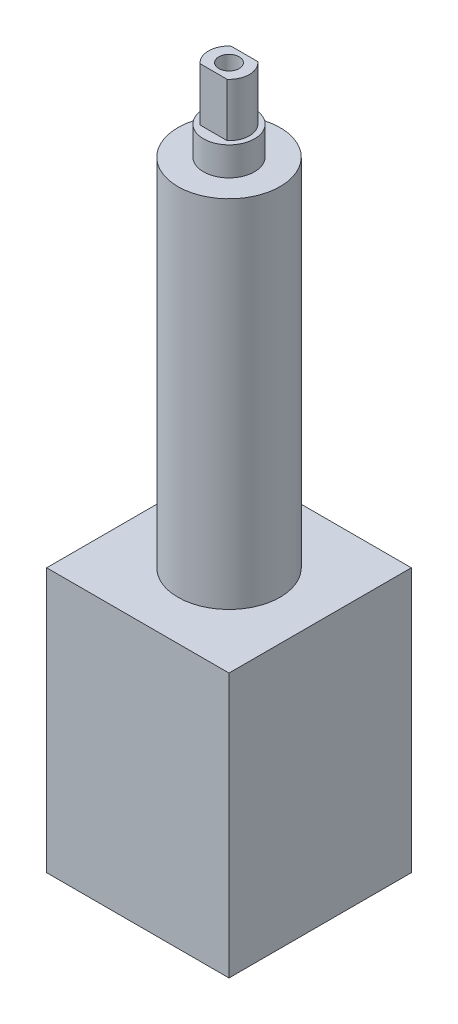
from build123d import *

# Parameters (mm, degrees)
SKETCH1_W                         = 56.642
SKETCH1_H                         = 56.642
EXTRUDE1_DEPTH                    = 82.042
SKETCH2_R                         = 15.875
EXTRUDE2_DEPTH                    = 110.49
SKETCH3_R                         = 7.9375
EXTRUDE3_DEPTH                    = 8.89
SKETCH4_R                         = 6.35
EXTRUDE4_DEPTH                    = 16.51
F_1_4_28_TAPPED_HOLE1_D           = 5.4102
F_1_4_28_TAPPED_HOLE1_DEPTH       = 12.192
F_1_4_28_TAPPED_HOLE1_CBORE_D     = 6.35
F_1_4_28_TAPPED_HOLE1_CBORE_DEPTH = 9.652
F_1_4_28_TAPPED_HOLE1_TIP         = 1.625388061
SKETCH7_W                         = 26.67
SKETCH7_H                         = 19.685
SKETCH7_W_2                       = 16.51
SKETCH7_H_2                       = 9.525
CUT_EXTRUDE2_DEPTH                = 16.51


with BuildPart() as part:
    # Sketch1 → Extrude1 (new body)
    with BuildSketch(Plane(origin=(0, 0, 0), x_dir=(1, 0, 0), z_dir=(0, 1, 0))):
        Rectangle(SKETCH1_W, SKETCH1_H)
    extrude(amount=EXTRUDE1_DEPTH)

    # Sketch2 → Extrude2 (add)
    with BuildSketch(Plane(origin=(0, 82.042, 0), x_dir=(-1, 0, 0), z_dir=(0, 1, 0))):
        with Locations(Location((0, 0, 0), (0, 0, 90))):
            Circle(SKETCH2_R)
    extrude(amount=EXTRUDE2_DEPTH)

    # Sketch3 → Extrude3 (add)
    with BuildSketch(Plane(origin=(0, 192.532, 0), x_dir=(-1, 0, 0), z_dir=(0, 1, 0))):
        with Locations(Location((0, 0, 0), (0, 0, 90))):
            Circle(SKETCH3_R)
    extrude(amount=EXTRUDE3_DEPTH)

    # Sketch4 → Extrude4 (add)
    with BuildSketch(Plane(origin=(0, 201.422, 0), x_dir=(-1, 0, 0), z_dir=(0, 1, 0))):
        with Locations(Location((0, 0, 0), (0, 0, 90))):
            Circle(SKETCH4_R)
    extrude(amount=EXTRUDE4_DEPTH)

    # 1_4-28 Tapped Hole1
    with Locations(Plane.ZX.offset(217.932)):
        with Locations((0, 0)):
            CounterBoreHole(F_1_4_28_TAPPED_HOLE1_D / 2, F_1_4_28_TAPPED_HOLE1_CBORE_D / 2, F_1_4_28_TAPPED_HOLE1_CBORE_DEPTH, depth=F_1_4_28_TAPPED_HOLE1_DEPTH)
            with Locations((0, 0, -(F_1_4_28_TAPPED_HOLE1_DEPTH + F_1_4_28_TAPPED_HOLE1_TIP / 2))):  # 118° drill point
                Cone(0, F_1_4_28_TAPPED_HOLE1_D / 2, F_1_4_28_TAPPED_HOLE1_TIP, mode=Mode.SUBTRACT)

    # Sketch7 → Cut-Extrude2 (cut)
    with BuildSketch(Plane(origin=(0, 217.932, 0), x_dir=(-1, 0, 0), z_dir=(0, 1, 0))):
        Rectangle(SKETCH7_W, SKETCH7_H)
        Rectangle(SKETCH7_W_2, SKETCH7_H_2, mode=Mode.SUBTRACT)
    extrude(amount=-CUT_EXTRUDE2_DEPTH, mode=Mode.SUBTRACT)


solid = part.part
